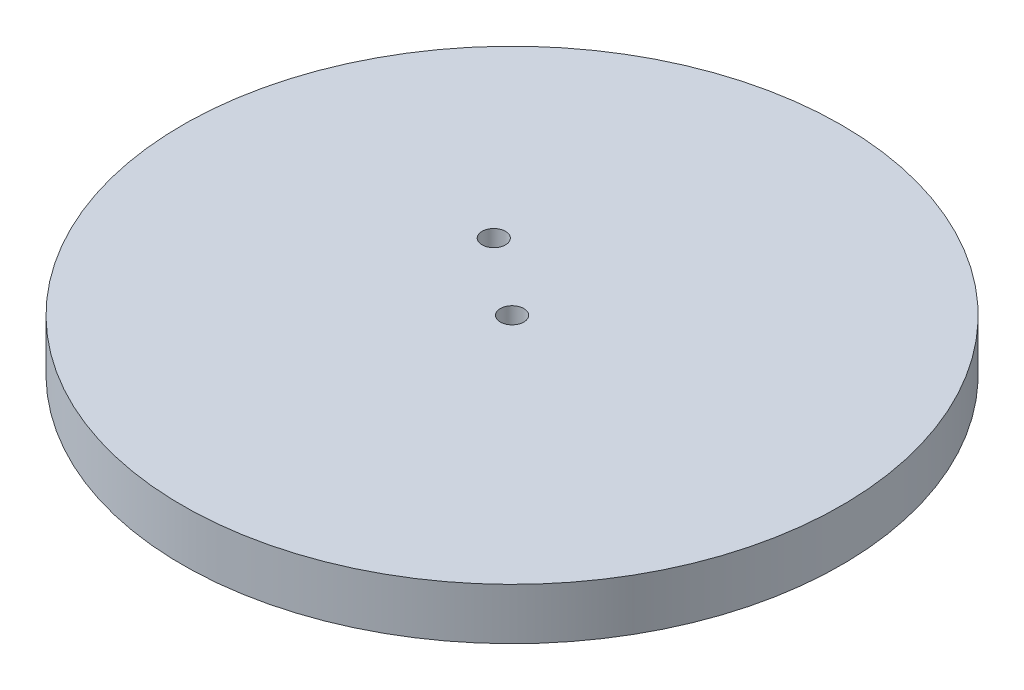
ISO-10303-21;
HEADER;
FILE_DESCRIPTION(('STEP AP214'),'2;1');
FILE_NAME('part.step','',(''),(''),'','','');
FILE_SCHEMA(('AUTOMOTIVE_DESIGN { 1 0 10303 214 1 1 1 1 }'));
ENDSEC;
DATA;
#1=APPLICATION_CONTEXT('core data for automotive mechanical design processes');
#2=APPLICATION_PROTOCOL_DEFINITION('international standard','automotive_design',2000,#1);
#3=PRODUCT_CONTEXT('',#1,'mechanical');
#4=PRODUCT('Part','Part','',(#3));
#5=PRODUCT_RELATED_PRODUCT_CATEGORY('part','',(#4));
#6=PRODUCT_DEFINITION_FORMATION('','',#4);
#7=PRODUCT_DEFINITION_CONTEXT('part definition',#1,'design');
#8=PRODUCT_DEFINITION('design','',#6,#7);
#9=PRODUCT_DEFINITION_SHAPE('','',#8);
#10=(LENGTH_UNIT() NAMED_UNIT(*) SI_UNIT(.MILLI.,.METRE.));
#11=(NAMED_UNIT(*) PLANE_ANGLE_UNIT() SI_UNIT($,.RADIAN.));
#12=(NAMED_UNIT(*) SI_UNIT($,.STERADIAN.) SOLID_ANGLE_UNIT());
#13=UNCERTAINTY_MEASURE_WITH_UNIT(LENGTH_MEASURE(1.E-05),#10,'distance_accuracy_value','');
#14=(GEOMETRIC_REPRESENTATION_CONTEXT(3) GLOBAL_UNCERTAINTY_ASSIGNED_CONTEXT((#13)) GLOBAL_UNIT_ASSIGNED_CONTEXT((#10,
#11,#12)) REPRESENTATION_CONTEXT('',''));
#15=CARTESIAN_POINT('',(0.,0.,0.));
#16=DIRECTION('',(0.,0.,1.));
#17=DIRECTION('',(1.,0.,0.));
#18=AXIS2_PLACEMENT_3D('',#15,#16,#17);
#19=CARTESIAN_POINT('',(0.,0.,0.));
#20=DIRECTION('',(0.,-1.,0.));
#21=DIRECTION('',(0.,0.,-1.));
#22=AXIS2_PLACEMENT_3D('',#19,#20,#21);
#23=SPHERICAL_SURFACE('',#22,11.);
#24=CARTESIAN_POINT('',(0.,-10.0816665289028,0.));
#25=DIRECTION('',(0.,1.,0.));
#26=DIRECTION('',(0.,0.,1.));
#27=AXIS2_PLACEMENT_3D('',#24,#25,#26);
#28=CIRCLE('',#27,4.4);
#29=CARTESIAN_POINT('',(0.,-10.0816665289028,4.4));
#30=VERTEX_POINT('',#29);
#31=EDGE_CURVE('E10',#30,#30,#28,.T.);
#32=ORIENTED_EDGE('',*,*,#31,.T.);
#33=EDGE_LOOP('',(#32));
#34=FACE_BOUND('',#33,.T.);
#35=CARTESIAN_POINT('',(0.,0.,0.));
#36=DIRECTION('',(0.,-1.,0.));
#37=DIRECTION('',(0.,0.,-1.));
#38=AXIS2_PLACEMENT_3D('',#35,#36,#37);
#39=CIRCLE('',#38,11.);
#40=CARTESIAN_POINT('',(0.,0.,-11.));
#41=VERTEX_POINT('',#40);
#42=EDGE_CURVE('E52',#41,#41,#39,.T.);
#43=ORIENTED_EDGE('',*,*,#42,.T.);
#44=EDGE_LOOP('',(#43));
#45=FACE_BOUND('',#44,.T.);
#46=ADVANCED_FACE('F41',(#34,#45),#23,.T.);
#47=CARTESIAN_POINT('',(0.,0.,0.));
#48=DIRECTION('',(0.,-1.,0.));
#49=DIRECTION('',(0.,0.,-1.));
#50=AXIS2_PLACEMENT_3D('',#47,#48,#49);
#51=PLANE('',#50);
#52=CARTESIAN_POINT('',(-10.352815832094,0.,-7.86251895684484));
#53=DIRECTION('',(0.,-1.,0.));
#54=DIRECTION('',(0.,0.,-1.));
#55=AXIS2_PLACEMENT_3D('',#52,#53,#54);
#56=CIRCLE('',#55,1.6);
#57=CARTESIAN_POINT('',(-10.352815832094,0.,-9.46251895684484));
#58=VERTEX_POINT('',#57);
#59=EDGE_CURVE('E64',#58,#58,#56,.T.);
#60=ORIENTED_EDGE('',*,*,#59,.F.);
#61=EDGE_LOOP('',(#60));
#62=FACE_BOUND('',#61,.T.);
#63=CARTESIAN_POINT('',(0.,0.,0.));
#64=DIRECTION('',(0.,-1.,0.));
#65=DIRECTION('',(0.,0.,-1.));
#66=AXIS2_PLACEMENT_3D('',#63,#64,#65);
#67=CIRCLE('',#66,25.1);
#68=CARTESIAN_POINT('',(0.,0.,-25.1));
#69=VERTEX_POINT('',#68);
#70=EDGE_CURVE('E57',#69,#69,#67,.T.);
#71=ORIENTED_EDGE('',*,*,#70,.T.);
#72=EDGE_LOOP('',(#71));
#73=FACE_BOUND('',#72,.T.);
#74=ORIENTED_EDGE('',*,*,#42,.F.);
#75=EDGE_LOOP('',(#74));
#76=FACE_BOUND('',#75,.T.);
#77=ADVANCED_FACE('F91',(#62,#73,#76),#51,.T.);
#78=CARTESIAN_POINT('',(0.,0.,0.));
#79=DIRECTION('',(0.,-1.,0.));
#80=DIRECTION('',(0.,0.,-1.));
#81=AXIS2_PLACEMENT_3D('',#78,#79,#80);
#82=CYLINDRICAL_SURFACE('',#81,25.1);
#83=CARTESIAN_POINT('',(0.,-3.53331012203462,0.));
#84=DIRECTION('',(0.,-1.,0.));
#85=DIRECTION('',(0.,0.,-1.));
#86=AXIS2_PLACEMENT_3D('',#83,#84,#85);
#87=CIRCLE('',#86,25.1);
#88=CARTESIAN_POINT('',(0.,-3.53331012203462,-25.1));
#89=VERTEX_POINT('',#88);
#90=EDGE_CURVE('E68',#89,#89,#87,.T.);
#91=ORIENTED_EDGE('',*,*,#90,.T.);
#92=EDGE_LOOP('',(#91));
#93=FACE_BOUND('',#92,.T.);
#94=ORIENTED_EDGE('',*,*,#70,.F.);
#95=EDGE_LOOP('',(#94));
#96=FACE_BOUND('',#95,.T.);
#97=ADVANCED_FACE('F94',(#93,#96),#82,.F.);
#98=CARTESIAN_POINT('',(0.,-3.53331012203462,0.));
#99=DIRECTION('',(0.,-1.,0.));
#100=DIRECTION('',(0.,0.,-1.));
#101=AXIS2_PLACEMENT_3D('',#98,#99,#100);
#102=PLANE('',#101);
#103=CARTESIAN_POINT('',(0.,-3.53331012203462,0.));
#104=DIRECTION('',(0.,-1.,0.));
#105=DIRECTION('',(0.,0.,-1.));
#106=AXIS2_PLACEMENT_3D('',#103,#104,#105);
#107=CIRCLE('',#106,34.9);
#108=CARTESIAN_POINT('',(0.,-3.53331012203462,-34.9));
#109=VERTEX_POINT('',#108);
#110=EDGE_CURVE('E71',#109,#109,#107,.T.);
#111=ORIENTED_EDGE('',*,*,#110,.T.);
#112=EDGE_LOOP('',(#111));
#113=FACE_BOUND('',#112,.T.);
#114=ORIENTED_EDGE('',*,*,#90,.F.);
#115=EDGE_LOOP('',(#114));
#116=FACE_BOUND('',#115,.T.);
#117=ADVANCED_FACE('F106',(#113,#116),#102,.T.);
#118=CARTESIAN_POINT('',(0.,0.,0.));
#119=DIRECTION('',(0.,-1.,0.));
#120=DIRECTION('',(0.,0.,-1.));
#121=AXIS2_PLACEMENT_3D('',#118,#119,#120);
#122=CYLINDRICAL_SURFACE('',#121,34.9);
#123=CARTESIAN_POINT('',(0.,0.,0.));
#124=DIRECTION('',(0.,-1.,0.));
#125=DIRECTION('',(0.,0.,-1.));
#126=AXIS2_PLACEMENT_3D('',#123,#124,#125);
#127=CIRCLE('',#126,34.9);
#128=CARTESIAN_POINT('',(0.,0.,-34.9));
#129=VERTEX_POINT('',#128);
#130=EDGE_CURVE('E74',#129,#129,#127,.T.);
#131=ORIENTED_EDGE('',*,*,#130,.T.);
#132=EDGE_LOOP('',(#131));
#133=FACE_BOUND('',#132,.T.);
#134=ORIENTED_EDGE('',*,*,#110,.F.);
#135=EDGE_LOOP('',(#134));
#136=FACE_BOUND('',#135,.T.);
#137=ADVANCED_FACE('F110',(#133,#136),#122,.T.);
#138=CARTESIAN_POINT('',(0.,0.,0.));
#139=DIRECTION('',(0.,-1.,0.));
#140=DIRECTION('',(0.,0.,-1.));
#141=AXIS2_PLACEMENT_3D('',#138,#139,#140);
#142=PLANE('',#141);
#143=CARTESIAN_POINT('',(0.,0.,0.));
#144=DIRECTION('',(0.,-1.,0.));
#145=DIRECTION('',(0.,0.,-1.));
#146=AXIS2_PLACEMENT_3D('',#143,#144,#145);
#147=CIRCLE('',#146,44.9);
#148=CARTESIAN_POINT('',(0.,0.,-44.9));
#149=VERTEX_POINT('',#148);
#150=EDGE_CURVE('E77',#149,#149,#147,.T.);
#151=ORIENTED_EDGE('',*,*,#150,.T.);
#152=EDGE_LOOP('',(#151));
#153=FACE_BOUND('',#152,.T.);
#154=ORIENTED_EDGE('',*,*,#130,.F.);
#155=EDGE_LOOP('',(#154));
#156=FACE_BOUND('',#155,.T.);
#157=ADVANCED_FACE('F114',(#153,#156),#142,.T.);
#158=CARTESIAN_POINT('',(0.,0.,0.));
#159=DIRECTION('',(0.,-1.,0.));
#160=DIRECTION('',(0.,0.,-1.));
#161=AXIS2_PLACEMENT_3D('',#158,#159,#160);
#162=CYLINDRICAL_SURFACE('',#161,44.9);
#163=CARTESIAN_POINT('',(0.,7.,0.));
#164=DIRECTION('',(0.,-1.,0.));
#165=DIRECTION('',(0.,0.,-1.));
#166=AXIS2_PLACEMENT_3D('',#163,#164,#165);
#167=CIRCLE('',#166,44.9);
#168=CARTESIAN_POINT('',(0.,7.,-44.9));
#169=VERTEX_POINT('',#168);
#170=EDGE_CURVE('E80',#169,#169,#167,.T.);
#171=ORIENTED_EDGE('',*,*,#170,.T.);
#172=EDGE_LOOP('',(#171));
#173=FACE_BOUND('',#172,.T.);
#174=ORIENTED_EDGE('',*,*,#150,.F.);
#175=EDGE_LOOP('',(#174));
#176=FACE_BOUND('',#175,.T.);
#177=ADVANCED_FACE('F118',(#173,#176),#162,.T.);
#178=CARTESIAN_POINT('',(0.,7.,0.));
#179=DIRECTION('',(0.,1.,0.));
#180=DIRECTION('',(0.,0.,1.));
#181=AXIS2_PLACEMENT_3D('',#178,#179,#180);
#182=PLANE('',#181);
#183=CARTESIAN_POINT('',(-10.352815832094,7.,-7.86251895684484));
#184=DIRECTION('',(0.,1.,0.));
#185=DIRECTION('',(0.,0.,1.));
#186=AXIS2_PLACEMENT_3D('',#183,#184,#185);
#187=CIRCLE('',#186,1.6);
#188=CARTESIAN_POINT('',(-10.352815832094,7.,-6.26251895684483));
#189=VERTEX_POINT('',#188);
#190=EDGE_CURVE('E60',#189,#189,#187,.T.);
#191=ORIENTED_EDGE('',*,*,#190,.F.);
#192=EDGE_LOOP('',(#191));
#193=FACE_BOUND('',#192,.T.);
#194=CARTESIAN_POINT('',(0.,7.,0.));
#195=DIRECTION('',(0.,-1.,0.));
#196=DIRECTION('',(0.,0.,-1.));
#197=AXIS2_PLACEMENT_3D('',#194,#195,#196);
#198=CIRCLE('',#197,1.6);
#199=CARTESIAN_POINT('',(0.,7.,-1.6));
#200=VERTEX_POINT('',#199);
#201=EDGE_CURVE('E63',#200,#200,#198,.T.);
#202=ORIENTED_EDGE('',*,*,#201,.T.);
#203=EDGE_LOOP('',(#202));
#204=FACE_BOUND('',#203,.T.);
#205=ORIENTED_EDGE('',*,*,#170,.F.);
#206=EDGE_LOOP('',(#205));
#207=FACE_BOUND('',#206,.T.);
#208=ADVANCED_FACE('F122',(#193,#204,#207),#182,.T.);
#209=CARTESIAN_POINT('',(0.,0.,0.));
#210=DIRECTION('',(0.,-1.,0.));
#211=DIRECTION('',(0.,0.,-1.));
#212=AXIS2_PLACEMENT_3D('',#209,#210,#211);
#213=CYLINDRICAL_SURFACE('',#212,1.6);
#214=CARTESIAN_POINT('',(0.,-8.24863625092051,0.));
#215=DIRECTION('',(0.,1.,0.));
#216=DIRECTION('',(0.,0.,1.));
#217=AXIS2_PLACEMENT_3D('',#214,#215,#216);
#218=CIRCLE('',#217,1.6);
#219=CARTESIAN_POINT('',(0.,-8.24863625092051,1.6));
#220=VERTEX_POINT('',#219);
#221=EDGE_CURVE('E48',#220,#220,#218,.F.);
#222=ORIENTED_EDGE('',*,*,#221,.T.);
#223=EDGE_LOOP('',(#222));
#224=FACE_BOUND('',#223,.T.);
#225=ORIENTED_EDGE('',*,*,#201,.F.);
#226=EDGE_LOOP('',(#225));
#227=FACE_BOUND('',#226,.T.);
#228=ADVANCED_FACE('F126',(#224,#227),#213,.F.);
#229=CARTESIAN_POINT('',(-10.352815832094,10.,-7.86251895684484));
#230=DIRECTION('',(0.,-1.,0.));
#231=DIRECTION('',(0.,0.,-1.));
#232=AXIS2_PLACEMENT_3D('',#229,#230,#231);
#233=CYLINDRICAL_SURFACE('',#232,1.6);
#234=ORIENTED_EDGE('',*,*,#190,.T.);
#235=EDGE_LOOP('',(#234));
#236=FACE_BOUND('',#235,.T.);
#237=ORIENTED_EDGE('',*,*,#59,.T.);
#238=EDGE_LOOP('',(#237));
#239=FACE_BOUND('',#238,.T.);
#240=ADVANCED_FACE('F89',(#236,#239),#233,.F.);
#241=CARTESIAN_POINT('',(0.,-8.24863625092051,0.));
#242=DIRECTION('',(0.,1.,0.));
#243=DIRECTION('',(0.,0.,1.));
#244=AXIS2_PLACEMENT_3D('',#241,#242,#243);
#245=TOROIDAL_SURFACE('',#244,3.6,2.);
#246=ORIENTED_EDGE('',*,*,#31,.F.);
#247=EDGE_LOOP('',(#246));
#248=FACE_BOUND('',#247,.T.);
#249=ORIENTED_EDGE('',*,*,#221,.F.);
#250=EDGE_LOOP('',(#249));
#251=FACE_BOUND('',#250,.T.);
#252=ADVANCED_FACE('F43',(#248,#251),#245,.T.);
#253=CLOSED_SHELL('',(#46,#77,#97,#117,#137,#157,#177,#208,#228,#240,#252));
#254=MANIFOLD_SOLID_BREP('B2',#253);
#255=ADVANCED_BREP_SHAPE_REPRESENTATION('',(#18,#254),#14);
#256=SHAPE_DEFINITION_REPRESENTATION(#9,#255);
ENDSEC;
END-ISO-10303-21;
